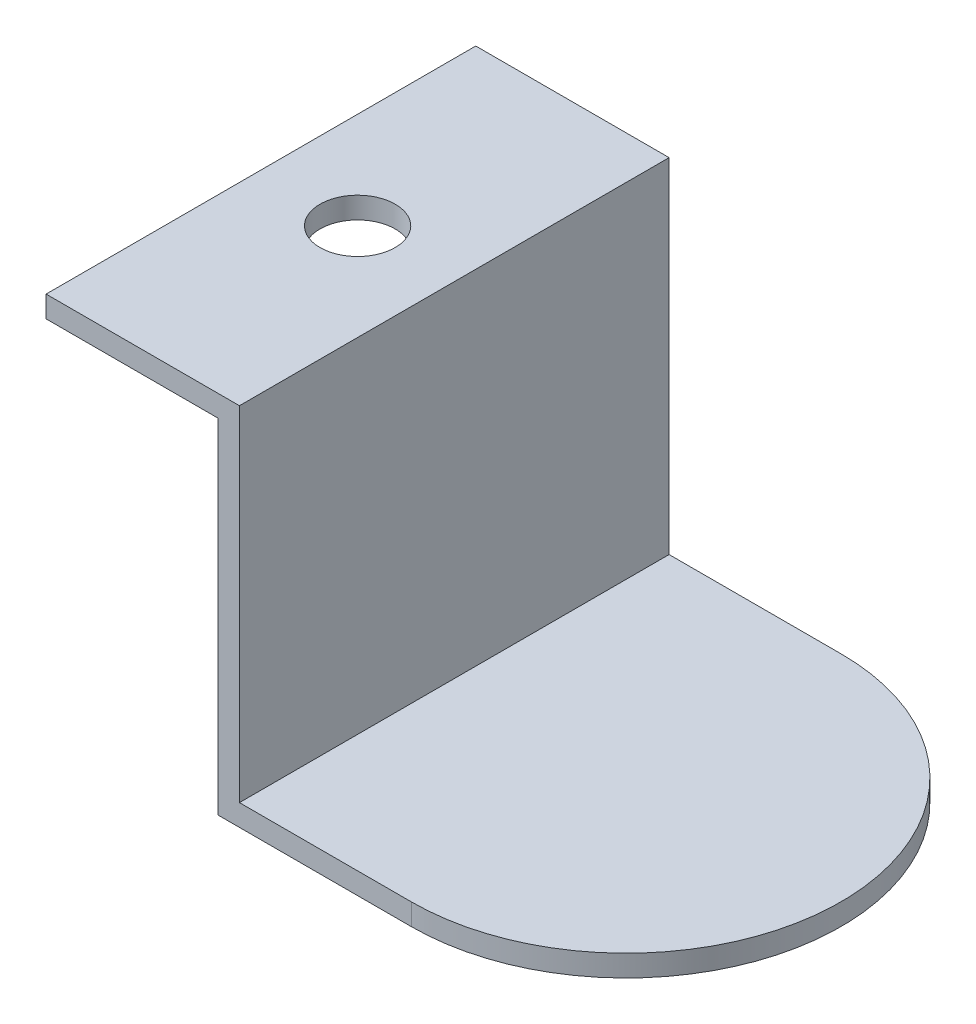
ISO-10303-21;
HEADER;
FILE_DESCRIPTION(('STEP AP214'),'2;1');
FILE_NAME('part.step','',(''),(''),'','','');
FILE_SCHEMA(('AUTOMOTIVE_DESIGN { 1 0 10303 214 1 1 1 1 }'));
ENDSEC;
DATA;
#1=APPLICATION_CONTEXT('core data for automotive mechanical design processes');
#2=APPLICATION_PROTOCOL_DEFINITION('international standard','automotive_design',2000,#1);
#3=PRODUCT_CONTEXT('',#1,'mechanical');
#4=PRODUCT('Part','Part','',(#3));
#5=PRODUCT_RELATED_PRODUCT_CATEGORY('part','',(#4));
#6=PRODUCT_DEFINITION_FORMATION('','',#4);
#7=PRODUCT_DEFINITION_CONTEXT('part definition',#1,'design');
#8=PRODUCT_DEFINITION('design','',#6,#7);
#9=PRODUCT_DEFINITION_SHAPE('','',#8);
#10=(LENGTH_UNIT() NAMED_UNIT(*) SI_UNIT(.MILLI.,.METRE.));
#11=(NAMED_UNIT(*) PLANE_ANGLE_UNIT() SI_UNIT($,.RADIAN.));
#12=(NAMED_UNIT(*) SI_UNIT($,.STERADIAN.) SOLID_ANGLE_UNIT());
#13=UNCERTAINTY_MEASURE_WITH_UNIT(LENGTH_MEASURE(1.E-05),#10,'distance_accuracy_value','');
#14=(GEOMETRIC_REPRESENTATION_CONTEXT(3) GLOBAL_UNCERTAINTY_ASSIGNED_CONTEXT((#13)) GLOBAL_UNIT_ASSIGNED_CONTEXT((#10,
#11,#12)) REPRESENTATION_CONTEXT('',''));
#15=CARTESIAN_POINT('',(0.,0.,0.));
#16=DIRECTION('',(0.,0.,1.));
#17=DIRECTION('',(1.,0.,0.));
#18=AXIS2_PLACEMENT_3D('',#15,#16,#17);
#19=CARTESIAN_POINT('',(0.,0.,20.));
#20=DIRECTION('',(1.,0.,0.));
#21=DIRECTION('',(0.,0.,-1.));
#22=AXIS2_PLACEMENT_3D('',#19,#20,#21);
#23=PLANE('',#22);
#24=DIRECTION('',(0.,-1.,0.));
#25=VECTOR('',#24,1.);
#26=CARTESIAN_POINT('',(0.,0.,0.));
#27=LINE('',#26,#25);
#28=CARTESIAN_POINT('',(0.,0.,0.));
#29=VERTEX_POINT('',#28);
#30=CARTESIAN_POINT('',(0.,-1.,0.));
#31=VERTEX_POINT('',#30);
#32=EDGE_CURVE('E142',#29,#31,#27,.T.);
#33=ORIENTED_EDGE('',*,*,#32,.T.);
#34=DIRECTION('',(0.,0.,-1.));
#35=VECTOR('',#34,1.);
#36=CARTESIAN_POINT('',(0.,-1.,20.));
#37=LINE('',#36,#35);
#38=CARTESIAN_POINT('',(0.,-1.,20.));
#39=VERTEX_POINT('',#38);
#40=EDGE_CURVE('E37',#39,#31,#37,.T.);
#41=ORIENTED_EDGE('',*,*,#40,.F.);
#42=DIRECTION('',(0.,-1.,0.));
#43=VECTOR('',#42,1.);
#44=CARTESIAN_POINT('',(0.,0.,20.));
#45=LINE('',#44,#43);
#46=CARTESIAN_POINT('',(0.,0.,20.));
#47=VERTEX_POINT('',#46);
#48=EDGE_CURVE('E164',#47,#39,#45,.T.);
#49=ORIENTED_EDGE('',*,*,#48,.F.);
#50=DIRECTION('',(0.,0.,-1.));
#51=VECTOR('',#50,1.);
#52=CARTESIAN_POINT('',(0.,0.,20.));
#53=LINE('',#52,#51);
#54=EDGE_CURVE('E119',#47,#29,#53,.T.);
#55=ORIENTED_EDGE('',*,*,#54,.T.);
#56=EDGE_LOOP('',(#33,#41,#49,#55));
#57=FACE_BOUND('',#56,.T.);
#58=ADVANCED_FACE('F30',(#57),#23,.F.);
#59=CARTESIAN_POINT('',(0.,-1.,20.));
#60=DIRECTION('',(0.,1.,0.));
#61=DIRECTION('',(0.,0.,1.));
#62=AXIS2_PLACEMENT_3D('',#59,#60,#61);
#63=PLANE('',#62);
#64=CARTESIAN_POINT('',(4.5,-1.,10.));
#65=DIRECTION('',(0.,1.,0.));
#66=DIRECTION('',(0.,0.,1.));
#67=AXIS2_PLACEMENT_3D('',#64,#65,#66);
#68=CIRCLE('',#67,1.75);
#69=CARTESIAN_POINT('',(4.5,-1.,11.75));
#70=VERTEX_POINT('',#69);
#71=EDGE_CURVE('E145',#70,#70,#68,.T.);
#72=ORIENTED_EDGE('',*,*,#71,.T.);
#73=EDGE_LOOP('',(#72));
#74=FACE_BOUND('',#73,.T.);
#75=DIRECTION('',(1.,0.,0.));
#76=VECTOR('',#75,1.);
#77=CARTESIAN_POINT('',(0.,-1.,0.));
#78=LINE('',#77,#76);
#79=CARTESIAN_POINT('',(8.,-1.,0.));
#80=VERTEX_POINT('',#79);
#81=EDGE_CURVE('E137',#31,#80,#78,.T.);
#82=ORIENTED_EDGE('',*,*,#81,.T.);
#83=DIRECTION('',(0.,0.,-1.));
#84=VECTOR('',#83,1.);
#85=CARTESIAN_POINT('',(8.,-1.,20.));
#86=LINE('',#85,#84);
#87=CARTESIAN_POINT('',(8.,-1.,20.));
#88=VERTEX_POINT('',#87);
#89=EDGE_CURVE('E129',#88,#80,#86,.T.);
#90=ORIENTED_EDGE('',*,*,#89,.F.);
#91=DIRECTION('',(1.,0.,0.));
#92=VECTOR('',#91,1.);
#93=CARTESIAN_POINT('',(0.,-1.,20.));
#94=LINE('',#93,#92);
#95=EDGE_CURVE('E138',#39,#88,#94,.T.);
#96=ORIENTED_EDGE('',*,*,#95,.F.);
#97=ORIENTED_EDGE('',*,*,#40,.T.);
#98=EDGE_LOOP('',(#82,#90,#96,#97));
#99=FACE_BOUND('',#98,.T.);
#100=ADVANCED_FACE('F135',(#74,#99),#63,.F.);
#101=CARTESIAN_POINT('',(8.,-1.,20.));
#102=DIRECTION('',(1.,0.,0.));
#103=DIRECTION('',(0.,0.,-1.));
#104=AXIS2_PLACEMENT_3D('',#101,#102,#103);
#105=PLANE('',#104);
#106=DIRECTION('',(0.,-1.,0.));
#107=VECTOR('',#106,1.);
#108=CARTESIAN_POINT('',(8.,-1.,0.));
#109=LINE('',#108,#107);
#110=CARTESIAN_POINT('',(8.,-17.,0.));
#111=VERTEX_POINT('',#110);
#112=EDGE_CURVE('E147',#80,#111,#109,.T.);
#113=ORIENTED_EDGE('',*,*,#112,.T.);
#114=DIRECTION('',(0.,0.,-1.));
#115=VECTOR('',#114,1.);
#116=CARTESIAN_POINT('',(8.,-17.,20.));
#117=LINE('',#116,#115);
#118=CARTESIAN_POINT('',(8.,-17.,20.));
#119=VERTEX_POINT('',#118);
#120=EDGE_CURVE('E126',#119,#111,#117,.T.);
#121=ORIENTED_EDGE('',*,*,#120,.F.);
#122=DIRECTION('',(0.,-1.,0.));
#123=VECTOR('',#122,1.);
#124=CARTESIAN_POINT('',(8.,-1.,20.));
#125=LINE('',#124,#123);
#126=EDGE_CURVE('E114',#88,#119,#125,.T.);
#127=ORIENTED_EDGE('',*,*,#126,.F.);
#128=ORIENTED_EDGE('',*,*,#89,.T.);
#129=EDGE_LOOP('',(#113,#121,#127,#128));
#130=FACE_BOUND('',#129,.T.);
#131=ADVANCED_FACE('F169',(#130),#105,.F.);
#132=CARTESIAN_POINT('',(8.,-17.,20.));
#133=DIRECTION('',(0.,1.,0.));
#134=DIRECTION('',(0.,0.,1.));
#135=AXIS2_PLACEMENT_3D('',#132,#133,#134);
#136=PLANE('',#135);
#137=DIRECTION('',(1.,0.,0.));
#138=VECTOR('',#137,1.);
#139=CARTESIAN_POINT('',(8.,-17.,0.));
#140=LINE('',#139,#138);
#141=CARTESIAN_POINT('',(17.,-17.,0.));
#142=VERTEX_POINT('',#141);
#143=EDGE_CURVE('E155',#111,#142,#140,.T.);
#144=ORIENTED_EDGE('',*,*,#143,.T.);
#145=CARTESIAN_POINT('',(17.,-17.,10.));
#146=DIRECTION('',(0.,1.,0.));
#147=DIRECTION('',(0.,0.,1.));
#148=AXIS2_PLACEMENT_3D('',#145,#146,#147);
#149=CIRCLE('',#148,10.);
#150=CARTESIAN_POINT('',(17.,-17.,20.));
#151=VERTEX_POINT('',#150);
#152=EDGE_CURVE('E44',#142,#151,#149,.F.);
#153=ORIENTED_EDGE('',*,*,#152,.T.);
#154=DIRECTION('',(1.,0.,0.));
#155=VECTOR('',#154,1.);
#156=CARTESIAN_POINT('',(8.,-17.,20.));
#157=LINE('',#156,#155);
#158=EDGE_CURVE('E105',#119,#151,#157,.T.);
#159=ORIENTED_EDGE('',*,*,#158,.F.);
#160=ORIENTED_EDGE('',*,*,#120,.T.);
#161=EDGE_LOOP('',(#144,#153,#159,#160));
#162=FACE_BOUND('',#161,.T.);
#163=ADVANCED_FACE('F173',(#162),#136,.F.);
#164=CARTESIAN_POINT('',(9.,-16.,20.));
#165=DIRECTION('',(0.,-1.,0.));
#166=DIRECTION('',(0.,0.,-1.));
#167=AXIS2_PLACEMENT_3D('',#164,#165,#166);
#168=PLANE('',#167);
#169=DIRECTION('',(-1.,0.,0.));
#170=VECTOR('',#169,1.);
#171=CARTESIAN_POINT('',(9.,-16.,20.));
#172=LINE('',#171,#170);
#173=CARTESIAN_POINT('',(17.,-16.,20.));
#174=VERTEX_POINT('',#173);
#175=CARTESIAN_POINT('',(9.,-16.,20.));
#176=VERTEX_POINT('',#175);
#177=EDGE_CURVE('E102',#174,#176,#172,.T.);
#178=ORIENTED_EDGE('',*,*,#177,.F.);
#179=CARTESIAN_POINT('',(17.,-16.,10.));
#180=DIRECTION('',(0.,-1.,0.));
#181=DIRECTION('',(0.,0.,1.));
#182=AXIS2_PLACEMENT_3D('',#179,#180,#181);
#183=CIRCLE('',#182,10.);
#184=CARTESIAN_POINT('',(17.,-16.,0.));
#185=VERTEX_POINT('',#184);
#186=EDGE_CURVE('E92',#185,#174,#183,.T.);
#187=ORIENTED_EDGE('',*,*,#186,.F.);
#188=DIRECTION('',(-1.,0.,0.));
#189=VECTOR('',#188,1.);
#190=CARTESIAN_POINT('',(9.,-16.,0.));
#191=LINE('',#190,#189);
#192=CARTESIAN_POINT('',(9.,-16.,0.));
#193=VERTEX_POINT('',#192);
#194=EDGE_CURVE('E158',#185,#193,#191,.T.);
#195=ORIENTED_EDGE('',*,*,#194,.T.);
#196=DIRECTION('',(0.,0.,-1.));
#197=VECTOR('',#196,1.);
#198=CARTESIAN_POINT('',(9.,-16.,20.));
#199=LINE('',#198,#197);
#200=EDGE_CURVE('E109',#176,#193,#199,.T.);
#201=ORIENTED_EDGE('',*,*,#200,.F.);
#202=EDGE_LOOP('',(#178,#187,#195,#201));
#203=FACE_BOUND('',#202,.T.);
#204=ADVANCED_FACE('F107',(#203),#168,.F.);
#205=CARTESIAN_POINT('',(9.,0.,20.));
#206=DIRECTION('',(-1.,0.,0.));
#207=DIRECTION('',(0.,-1.,0.));
#208=AXIS2_PLACEMENT_3D('',#205,#206,#207);
#209=PLANE('',#208);
#210=DIRECTION('',(0.,1.,0.));
#211=VECTOR('',#210,1.);
#212=CARTESIAN_POINT('',(9.,0.,0.));
#213=LINE('',#212,#211);
#214=CARTESIAN_POINT('',(9.,0.,0.));
#215=VERTEX_POINT('',#214);
#216=EDGE_CURVE('E160',#193,#215,#213,.T.);
#217=ORIENTED_EDGE('',*,*,#216,.T.);
#218=DIRECTION('',(0.,0.,-1.));
#219=VECTOR('',#218,1.);
#220=CARTESIAN_POINT('',(9.,0.,20.));
#221=LINE('',#220,#219);
#222=CARTESIAN_POINT('',(9.,0.,20.));
#223=VERTEX_POINT('',#222);
#224=EDGE_CURVE('E122',#223,#215,#221,.T.);
#225=ORIENTED_EDGE('',*,*,#224,.F.);
#226=DIRECTION('',(0.,1.,0.));
#227=VECTOR('',#226,1.);
#228=CARTESIAN_POINT('',(9.,0.,20.));
#229=LINE('',#228,#227);
#230=EDGE_CURVE('E111',#176,#223,#229,.T.);
#231=ORIENTED_EDGE('',*,*,#230,.F.);
#232=ORIENTED_EDGE('',*,*,#200,.T.);
#233=EDGE_LOOP('',(#217,#225,#231,#232));
#234=FACE_BOUND('',#233,.T.);
#235=ADVANCED_FACE('F184',(#234),#209,.F.);
#236=CARTESIAN_POINT('',(0.,0.,20.));
#237=DIRECTION('',(0.,-1.,0.));
#238=DIRECTION('',(0.,0.,-1.));
#239=AXIS2_PLACEMENT_3D('',#236,#237,#238);
#240=PLANE('',#239);
#241=CARTESIAN_POINT('',(4.5,0.,10.));
#242=DIRECTION('',(0.,1.,0.));
#243=DIRECTION('',(0.,0.,1.));
#244=AXIS2_PLACEMENT_3D('',#241,#242,#243);
#245=CIRCLE('',#244,1.75);
#246=CARTESIAN_POINT('',(4.5,0.,11.75));
#247=VERTEX_POINT('',#246);
#248=EDGE_CURVE('E150',#247,#247,#245,.T.);
#249=ORIENTED_EDGE('',*,*,#248,.F.);
#250=EDGE_LOOP('',(#249));
#251=FACE_BOUND('',#250,.T.);
#252=DIRECTION('',(-1.,0.,0.));
#253=VECTOR('',#252,1.);
#254=CARTESIAN_POINT('',(0.,0.,0.));
#255=LINE('',#254,#253);
#256=EDGE_CURVE('E162',#215,#29,#255,.T.);
#257=ORIENTED_EDGE('',*,*,#256,.T.);
#258=ORIENTED_EDGE('',*,*,#54,.F.);
#259=DIRECTION('',(-1.,0.,0.));
#260=VECTOR('',#259,1.);
#261=CARTESIAN_POINT('',(0.,0.,20.));
#262=LINE('',#261,#260);
#263=EDGE_CURVE('E51',#223,#47,#262,.T.);
#264=ORIENTED_EDGE('',*,*,#263,.F.);
#265=ORIENTED_EDGE('',*,*,#224,.T.);
#266=EDGE_LOOP('',(#257,#258,#264,#265));
#267=FACE_BOUND('',#266,.T.);
#268=ADVANCED_FACE('F181',(#251,#267),#240,.F.);
#269=CARTESIAN_POINT('',(0.,-1.,20.));
#270=DIRECTION('',(0.,0.,1.));
#271=DIRECTION('',(1.,0.,0.));
#272=AXIS2_PLACEMENT_3D('',#269,#270,#271);
#273=PLANE('',#272);
#274=DIRECTION('',(0.,1.,0.));
#275=VECTOR('',#274,1.);
#276=CARTESIAN_POINT('',(17.,-36.,20.));
#277=LINE('',#276,#275);
#278=EDGE_CURVE('E95',#151,#174,#277,.T.);
#279=ORIENTED_EDGE('',*,*,#278,.T.);
#280=ORIENTED_EDGE('',*,*,#177,.T.);
#281=ORIENTED_EDGE('',*,*,#230,.T.);
#282=ORIENTED_EDGE('',*,*,#263,.T.);
#283=ORIENTED_EDGE('',*,*,#48,.T.);
#284=ORIENTED_EDGE('',*,*,#95,.T.);
#285=ORIENTED_EDGE('',*,*,#126,.T.);
#286=ORIENTED_EDGE('',*,*,#158,.T.);
#287=EDGE_LOOP('',(#279,#280,#281,#282,#283,#284,#285,#286));
#288=FACE_BOUND('',#287,.T.);
#289=ADVANCED_FACE('F101',(#288),#273,.T.);
#290=CARTESIAN_POINT('',(0.,-1.,0.));
#291=DIRECTION('',(0.,0.,1.));
#292=DIRECTION('',(1.,0.,0.));
#293=AXIS2_PLACEMENT_3D('',#290,#291,#292);
#294=PLANE('',#293);
#295=ORIENTED_EDGE('',*,*,#194,.F.);
#296=DIRECTION('',(0.,1.,0.));
#297=VECTOR('',#296,1.);
#298=CARTESIAN_POINT('',(17.,-36.,0.));
#299=LINE('',#298,#297);
#300=EDGE_CURVE('E11',#185,#142,#299,.F.);
#301=ORIENTED_EDGE('',*,*,#300,.T.);
#302=ORIENTED_EDGE('',*,*,#143,.F.);
#303=ORIENTED_EDGE('',*,*,#112,.F.);
#304=ORIENTED_EDGE('',*,*,#81,.F.);
#305=ORIENTED_EDGE('',*,*,#32,.F.);
#306=ORIENTED_EDGE('',*,*,#256,.F.);
#307=ORIENTED_EDGE('',*,*,#216,.F.);
#308=EDGE_LOOP('',(#295,#301,#302,#303,#304,#305,#306,#307));
#309=FACE_BOUND('',#308,.T.);
#310=ADVANCED_FACE('F188',(#309),#294,.F.);
#311=CARTESIAN_POINT('',(4.5,-20.,10.));
#312=DIRECTION('',(0.,1.,0.));
#313=DIRECTION('',(0.,0.,1.));
#314=AXIS2_PLACEMENT_3D('',#311,#312,#313);
#315=CYLINDRICAL_SURFACE('',#314,1.75);
#316=ORIENTED_EDGE('',*,*,#248,.T.);
#317=EDGE_LOOP('',(#316));
#318=FACE_BOUND('',#317,.T.);
#319=ORIENTED_EDGE('',*,*,#71,.F.);
#320=EDGE_LOOP('',(#319));
#321=FACE_BOUND('',#320,.T.);
#322=ADVANCED_FACE('F178',(#318,#321),#315,.F.);
#323=CARTESIAN_POINT('',(17.,-36.,10.));
#324=DIRECTION('',(0.,1.,0.));
#325=DIRECTION('',(0.,0.,1.));
#326=AXIS2_PLACEMENT_3D('',#323,#324,#325);
#327=CYLINDRICAL_SURFACE('',#326,10.);
#328=ORIENTED_EDGE('',*,*,#300,.F.);
#329=ORIENTED_EDGE('',*,*,#186,.T.);
#330=ORIENTED_EDGE('',*,*,#278,.F.);
#331=ORIENTED_EDGE('',*,*,#152,.F.);
#332=EDGE_LOOP('',(#328,#329,#330,#331));
#333=FACE_BOUND('',#332,.T.);
#334=ADVANCED_FACE('F94',(#333),#327,.T.);
#335=CLOSED_SHELL('',(#58,#100,#131,#163,#204,#235,#268,#289,#310,#322,#334));
#336=MANIFOLD_SOLID_BREP('B2',#335);
#337=ADVANCED_BREP_SHAPE_REPRESENTATION('',(#18,#336),#14);
#338=SHAPE_DEFINITION_REPRESENTATION(#9,#337);
ENDSEC;
END-ISO-10303-21;
